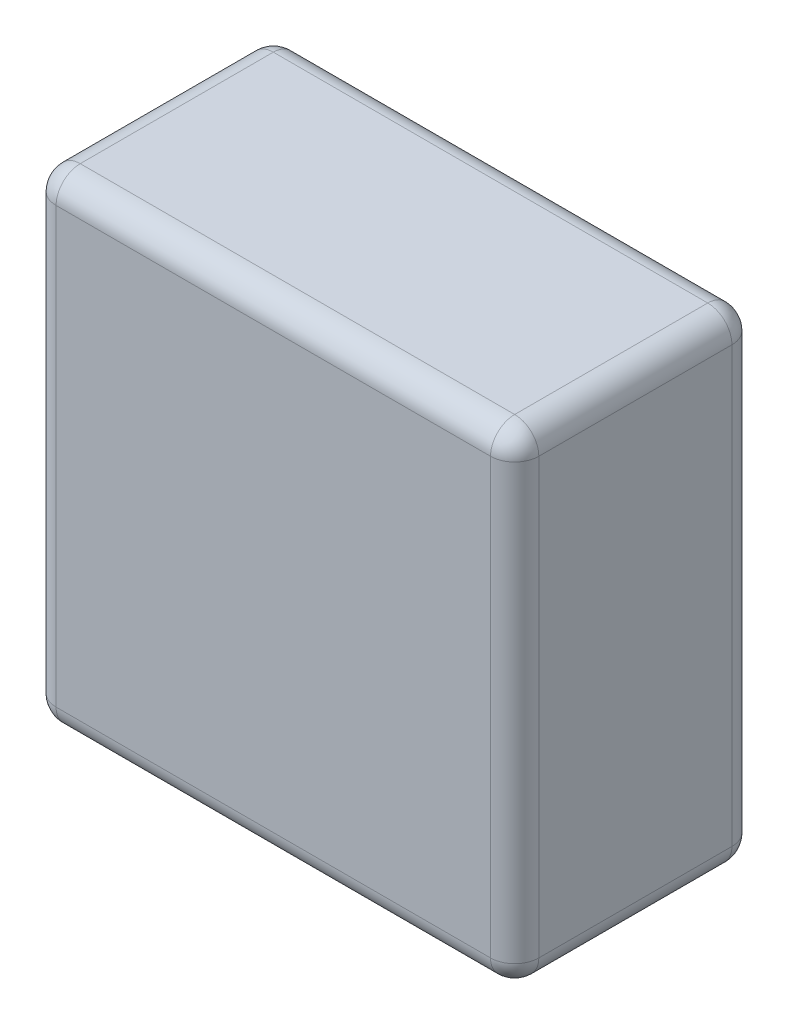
from build123d import *

# Parameters (mm, degrees)
SKETCH1_W           = 200
SKETCH1_H           = 200
BOSS_EXTRUDE1_DEPTH = 100
FILLET1_R           = 10


with BuildPart() as part:
    # Sketch1 → Boss-Extrude1 (new body)
    with BuildSketch(Plane.XY):
        with Locations((-226.4, 9.6)):
            Rectangle(SKETCH1_W, SKETCH1_H)
    extrude(amount=BOSS_EXTRUDE1_DEPTH)

    # Fillet1
    fillet1_edges = [part.edges().sort_by_distance(p)[0] for p in [
        (-126.4, 9.6, 100),
        (-226.4, 109.6, 100),
        (-326.4, 9.6, 100),
        (-226.4, 109.6, 0),
        (-126.4, 9.6, 0),
        (-226.4, -90.4, 0),
        (-326.4, 9.6, 0),
        (-226.4, -90.4, 100),
        (-326.4, 109.6, 50),
        (-126.4, 109.6, 50),
        (-126.4, -90.4, 50),
        (-326.4, -90.4, 50),
    ]]
    fillet(fillet1_edges, radius=FILLET1_R)


solid = part.part
